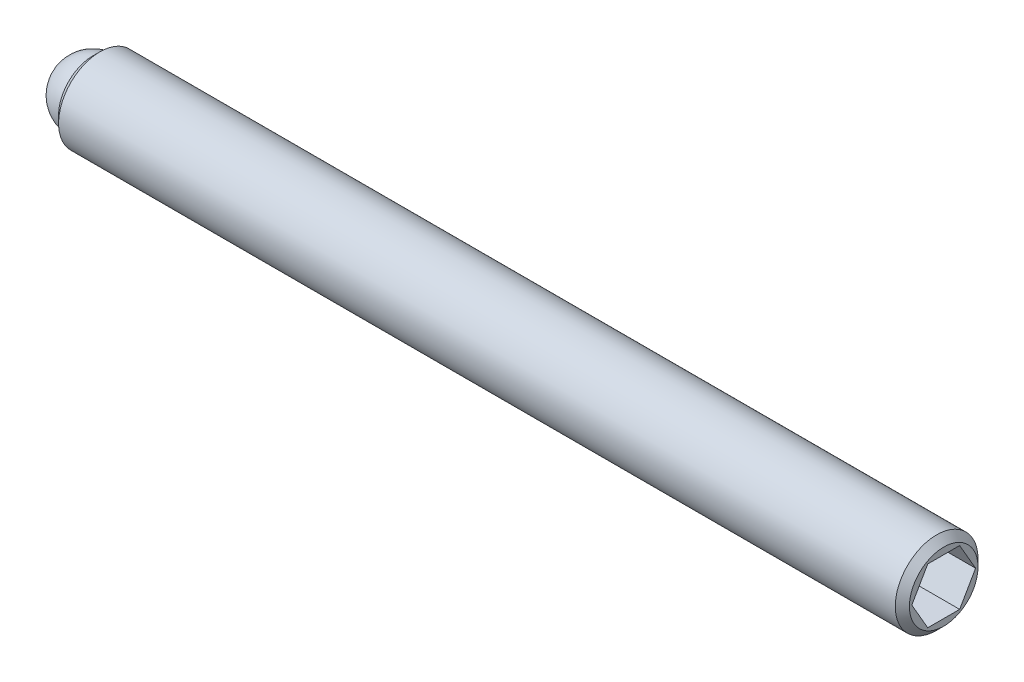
ISO-10303-21;
HEADER;
FILE_DESCRIPTION(('STEP AP214'),'2;1');
FILE_NAME('part.step','',(''),(''),'','','');
FILE_SCHEMA(('AUTOMOTIVE_DESIGN { 1 0 10303 214 1 1 1 1 }'));
ENDSEC;
DATA;
#1=APPLICATION_CONTEXT('core data for automotive mechanical design processes');
#2=APPLICATION_PROTOCOL_DEFINITION('international standard','automotive_design',2000,#1);
#3=PRODUCT_CONTEXT('',#1,'mechanical');
#4=PRODUCT('Part','Part','',(#3));
#5=PRODUCT_RELATED_PRODUCT_CATEGORY('part','',(#4));
#6=PRODUCT_DEFINITION_FORMATION('','',#4);
#7=PRODUCT_DEFINITION_CONTEXT('part definition',#1,'design');
#8=PRODUCT_DEFINITION('design','',#6,#7);
#9=PRODUCT_DEFINITION_SHAPE('','',#8);
#10=(LENGTH_UNIT() NAMED_UNIT(*) SI_UNIT(.MILLI.,.METRE.));
#11=(NAMED_UNIT(*) PLANE_ANGLE_UNIT() SI_UNIT($,.RADIAN.));
#12=(NAMED_UNIT(*) SI_UNIT($,.STERADIAN.) SOLID_ANGLE_UNIT());
#13=UNCERTAINTY_MEASURE_WITH_UNIT(LENGTH_MEASURE(1.E-05),#10,'distance_accuracy_value','');
#14=(GEOMETRIC_REPRESENTATION_CONTEXT(3) GLOBAL_UNCERTAINTY_ASSIGNED_CONTEXT((#13)) GLOBAL_UNIT_ASSIGNED_CONTEXT((#10,
#11,#12)) REPRESENTATION_CONTEXT('',''));
#15=CARTESIAN_POINT('',(0.,0.,0.));
#16=DIRECTION('',(0.,0.,1.));
#17=DIRECTION('',(1.,0.,0.));
#18=AXIS2_PLACEMENT_3D('',#15,#16,#17);
#19=CARTESIAN_POINT('',(0.,0.,0.));
#20=DIRECTION('',(0.,-1.,0.));
#21=DIRECTION('',(0.,0.,-1.));
#22=AXIS2_PLACEMENT_3D('',#19,#20,#21);
#23=SPHERICAL_SURFACE('',#22,1.190625);
#24=CARTESIAN_POINT('',(0.,-1.190625,0.));
#25=VERTEX_POINT('',#24);
#26=VERTEX_LOOP('',#25);
#27=FACE_BOUND('',#26,.T.);
#28=ADVANCED_FACE('F43',(#27),#23,.T.);
#29=CLOSED_SHELL('',(#28));
#30=MANIFOLD_SOLID_BREP('B2',#29);
#31=CARTESIAN_POINT('',(30.559375,0.,0.));
#32=DIRECTION('',(-1.,0.,0.));
#33=DIRECTION('',(0.,0.,1.));
#34=AXIS2_PLACEMENT_3D('',#31,#32,#33);
#35=CYLINDRICAL_SURFACE('',#34,1.4859);
#36=CARTESIAN_POINT('',(30.305375,0.,0.));
#37=DIRECTION('',(1.,0.,0.));
#38=DIRECTION('',(0.,0.,-1.));
#39=AXIS2_PLACEMENT_3D('',#36,#37,#38);
#40=CIRCLE('',#39,1.4859);
#41=CARTESIAN_POINT('',(30.305375,0.,-1.4859));
#42=VERTEX_POINT('',#41);
#43=EDGE_CURVE('E41',#42,#42,#40,.F.);
#44=ORIENTED_EDGE('',*,*,#43,.T.);
#45=EDGE_LOOP('',(#44));
#46=FACE_BOUND('',#45,.T.);
#47=CARTESIAN_POINT('',(0.253999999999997,0.,0.));
#48=DIRECTION('',(1.,0.,0.));
#49=DIRECTION('',(0.,0.,-1.));
#50=AXIS2_PLACEMENT_3D('',#47,#48,#49);
#51=CIRCLE('',#50,1.4859);
#52=CARTESIAN_POINT('',(0.253999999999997,0.,-1.4859));
#53=VERTEX_POINT('',#52);
#54=EDGE_CURVE('E159',#53,#53,#51,.T.);
#55=ORIENTED_EDGE('',*,*,#54,.T.);
#56=EDGE_LOOP('',(#55));
#57=FACE_BOUND('',#56,.T.);
#58=ADVANCED_FACE('F56',(#46,#57),#35,.T.);
#59=CARTESIAN_POINT('',(30.559375,0.,0.));
#60=DIRECTION('',(1.,0.,0.));
#61=DIRECTION('',(0.,0.,-1.));
#62=AXIS2_PLACEMENT_3D('',#59,#60,#61);
#63=PLANE('',#62);
#64=DIRECTION('',(0.,0.866025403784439,-0.5));
#65=VECTOR('',#64,1.);
#66=CARTESIAN_POINT('',(30.559375,-0.992187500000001,-0.572839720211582));
#67=LINE('',#66,#65);
#68=CARTESIAN_POINT('',(30.559375,-0.992187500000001,-0.572839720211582));
#69=VERTEX_POINT('',#68);
#70=CARTESIAN_POINT('',(30.559375,0.,-1.14567944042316));
#71=VERTEX_POINT('',#70);
#72=EDGE_CURVE('E71',#69,#71,#67,.T.);
#73=ORIENTED_EDGE('',*,*,#72,.F.);
#74=DIRECTION('',(0.,0.,-1.));
#75=VECTOR('',#74,1.);
#76=CARTESIAN_POINT('',(30.559375,-0.992187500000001,0.572839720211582));
#77=LINE('',#76,#75);
#78=CARTESIAN_POINT('',(30.559375,-0.992187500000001,0.572839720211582));
#79=VERTEX_POINT('',#78);
#80=EDGE_CURVE('E155',#79,#69,#77,.T.);
#81=ORIENTED_EDGE('',*,*,#80,.F.);
#82=DIRECTION('',(0.,-0.866025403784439,-0.5));
#83=VECTOR('',#82,1.);
#84=CARTESIAN_POINT('',(30.559375,0.,1.14567944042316));
#85=LINE('',#84,#83);
#86=CARTESIAN_POINT('',(30.559375,0.,1.14567944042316));
#87=VERTEX_POINT('',#86);
#88=EDGE_CURVE('E153',#87,#79,#85,.T.);
#89=ORIENTED_EDGE('',*,*,#88,.F.);
#90=DIRECTION('',(0.,-0.866025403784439,0.5));
#91=VECTOR('',#90,1.);
#92=CARTESIAN_POINT('',(30.559375,0.992187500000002,0.572839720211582));
#93=LINE('',#92,#91);
#94=CARTESIAN_POINT('',(30.559375,0.992187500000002,0.572839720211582));
#95=VERTEX_POINT('',#94);
#96=EDGE_CURVE('E119',#95,#87,#93,.T.);
#97=ORIENTED_EDGE('',*,*,#96,.F.);
#98=DIRECTION('',(0.,0.,1.));
#99=VECTOR('',#98,1.);
#100=CARTESIAN_POINT('',(30.559375,0.992187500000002,-0.572839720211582));
#101=LINE('',#100,#99);
#102=CARTESIAN_POINT('',(30.559375,0.992187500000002,-0.572839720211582));
#103=VERTEX_POINT('',#102);
#104=EDGE_CURVE('E149',#103,#95,#101,.T.);
#105=ORIENTED_EDGE('',*,*,#104,.F.);
#106=DIRECTION('',(0.,0.866025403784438,0.5));
#107=VECTOR('',#106,1.);
#108=CARTESIAN_POINT('',(30.559375,0.,-1.14567944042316));
#109=LINE('',#108,#107);
#110=EDGE_CURVE('E145',#71,#103,#109,.T.);
#111=ORIENTED_EDGE('',*,*,#110,.F.);
#112=EDGE_LOOP('',(#73,#81,#89,#97,#105,#111));
#113=FACE_BOUND('',#112,.T.);
#114=CARTESIAN_POINT('',(30.559375,0.,0.));
#115=DIRECTION('',(1.,0.,0.));
#116=DIRECTION('',(0.,0.,-1.));
#117=AXIS2_PLACEMENT_3D('',#114,#115,#116);
#118=CIRCLE('',#117,1.2319);
#119=CARTESIAN_POINT('',(30.559375,0.,-1.2319));
#120=VERTEX_POINT('',#119);
#121=EDGE_CURVE('E64',#120,#120,#118,.T.);
#122=ORIENTED_EDGE('',*,*,#121,.T.);
#123=EDGE_LOOP('',(#122));
#124=FACE_BOUND('',#123,.T.);
#125=ADVANCED_FACE('F172',(#113,#124),#63,.T.);
#126=CARTESIAN_POINT('',(0.,0.,0.));
#127=DIRECTION('',(1.,0.,0.));
#128=DIRECTION('',(0.,0.,-1.));
#129=AXIS2_PLACEMENT_3D('',#126,#127,#128);
#130=PLANE('',#129);
#131=CARTESIAN_POINT('',(0.,0.,0.));
#132=DIRECTION('',(-1.,0.,0.));
#133=DIRECTION('',(0.,0.,1.));
#134=AXIS2_PLACEMENT_3D('',#131,#132,#133);
#135=CIRCLE('',#134,1.190625);
#136=CARTESIAN_POINT('',(0.,0.,1.190625));
#137=VERTEX_POINT('',#136);
#138=EDGE_CURVE('E227',#137,#137,#135,.T.);
#139=ORIENTED_EDGE('',*,*,#138,.F.);
#140=EDGE_LOOP('',(#139));
#141=FACE_BOUND('',#140,.T.);
#142=CARTESIAN_POINT('',(0.,0.,0.));
#143=DIRECTION('',(1.,0.,0.));
#144=DIRECTION('',(0.,0.,-1.));
#145=AXIS2_PLACEMENT_3D('',#142,#143,#144);
#146=CIRCLE('',#145,1.2319);
#147=CARTESIAN_POINT('',(0.,0.,-1.2319));
#148=VERTEX_POINT('',#147);
#149=EDGE_CURVE('E167',#148,#148,#146,.F.);
#150=ORIENTED_EDGE('',*,*,#149,.T.);
#151=EDGE_LOOP('',(#150));
#152=FACE_BOUND('',#151,.T.);
#153=ADVANCED_FACE('F184',(#141,#152),#130,.F.);
#154=CARTESIAN_POINT('',(0.253999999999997,0.,0.));
#155=DIRECTION('',(1.,0.,0.));
#156=DIRECTION('',(0.,0.,-1.));
#157=AXIS2_PLACEMENT_3D('',#154,#155,#156);
#158=CONICAL_SURFACE('',#157,1.4859,0.785398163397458);
#159=ORIENTED_EDGE('',*,*,#149,.F.);
#160=EDGE_LOOP('',(#159));
#161=FACE_BOUND('',#160,.T.);
#162=ORIENTED_EDGE('',*,*,#54,.F.);
#163=EDGE_LOOP('',(#162));
#164=FACE_BOUND('',#163,.T.);
#165=ADVANCED_FACE('F176',(#161,#164),#158,.T.);
#166=CARTESIAN_POINT('',(30.559375,0.,0.));
#167=DIRECTION('',(-1.,0.,0.));
#168=DIRECTION('',(0.,0.,1.));
#169=AXIS2_PLACEMENT_3D('',#166,#167,#168);
#170=CONICAL_SURFACE('',#169,1.2319,0.785398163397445);
#171=ORIENTED_EDGE('',*,*,#43,.F.);
#172=EDGE_LOOP('',(#171));
#173=FACE_BOUND('',#172,.T.);
#174=ORIENTED_EDGE('',*,*,#121,.F.);
#175=EDGE_LOOP('',(#174));
#176=FACE_BOUND('',#175,.T.);
#177=ADVANCED_FACE('F58',(#173,#176),#170,.T.);
#178=CARTESIAN_POINT('',(28.273375,-0.992187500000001,-0.572839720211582));
#179=DIRECTION('',(0.,-0.5,-0.866025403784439));
#180=DIRECTION('',(0.,0.866025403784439,-0.5));
#181=AXIS2_PLACEMENT_3D('',#178,#179,#180);
#182=PLANE('',#181);
#183=ORIENTED_EDGE('',*,*,#72,.T.);
#184=DIRECTION('',(1.,0.,0.));
#185=VECTOR('',#184,1.);
#186=CARTESIAN_POINT('',(28.273375,0.,-1.14567944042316));
#187=LINE('',#186,#185);
#188=CARTESIAN_POINT('',(28.273375,0.,-1.14567944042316));
#189=VERTEX_POINT('',#188);
#190=EDGE_CURVE('E101',#189,#71,#187,.T.);
#191=ORIENTED_EDGE('',*,*,#190,.F.);
#192=DIRECTION('',(0.,0.866025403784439,-0.5));
#193=VECTOR('',#192,1.);
#194=CARTESIAN_POINT('',(28.273375,-0.992187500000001,-0.572839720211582));
#195=LINE('',#194,#193);
#196=CARTESIAN_POINT('',(28.273375,-0.992187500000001,-0.572839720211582));
#197=VERTEX_POINT('',#196);
#198=EDGE_CURVE('E157',#197,#189,#195,.T.);
#199=ORIENTED_EDGE('',*,*,#198,.F.);
#200=DIRECTION('',(1.,0.,0.));
#201=VECTOR('',#200,1.);
#202=CARTESIAN_POINT('',(28.273375,-0.992187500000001,-0.572839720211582));
#203=LINE('',#202,#201);
#204=EDGE_CURVE('E79',#197,#69,#203,.T.);
#205=ORIENTED_EDGE('',*,*,#204,.T.);
#206=EDGE_LOOP('',(#183,#191,#199,#205));
#207=FACE_BOUND('',#206,.T.);
#208=ADVANCED_FACE('F175',(#207),#182,.F.);
#209=CARTESIAN_POINT('',(28.273375,-0.992187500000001,0.572839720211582));
#210=DIRECTION('',(0.,-1.,0.));
#211=DIRECTION('',(0.,0.,-1.));
#212=AXIS2_PLACEMENT_3D('',#209,#210,#211);
#213=PLANE('',#212);
#214=ORIENTED_EDGE('',*,*,#80,.T.);
#215=ORIENTED_EDGE('',*,*,#204,.F.);
#216=DIRECTION('',(0.,0.,-1.));
#217=VECTOR('',#216,1.);
#218=CARTESIAN_POINT('',(28.273375,-0.992187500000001,0.572839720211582));
#219=LINE('',#218,#217);
#220=CARTESIAN_POINT('',(28.273375,-0.992187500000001,0.572839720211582));
#221=VERTEX_POINT('',#220);
#222=EDGE_CURVE('E131',#221,#197,#219,.T.);
#223=ORIENTED_EDGE('',*,*,#222,.F.);
#224=DIRECTION('',(1.,0.,0.));
#225=VECTOR('',#224,1.);
#226=CARTESIAN_POINT('',(28.273375,-0.992187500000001,0.572839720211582));
#227=LINE('',#226,#225);
#228=EDGE_CURVE('E123',#221,#79,#227,.T.);
#229=ORIENTED_EDGE('',*,*,#228,.T.);
#230=EDGE_LOOP('',(#214,#215,#223,#229));
#231=FACE_BOUND('',#230,.T.);
#232=ADVANCED_FACE('F182',(#231),#213,.F.);
#233=CARTESIAN_POINT('',(28.273375,0.,1.14567944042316));
#234=DIRECTION('',(0.,-0.5,0.866025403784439));
#235=DIRECTION('',(0.,-0.866025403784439,-0.5));
#236=AXIS2_PLACEMENT_3D('',#233,#234,#235);
#237=PLANE('',#236);
#238=ORIENTED_EDGE('',*,*,#88,.T.);
#239=ORIENTED_EDGE('',*,*,#228,.F.);
#240=DIRECTION('',(0.,-0.866025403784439,-0.5));
#241=VECTOR('',#240,1.);
#242=CARTESIAN_POINT('',(28.273375,0.,1.14567944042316));
#243=LINE('',#242,#241);
#244=CARTESIAN_POINT('',(28.273375,0.,1.14567944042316));
#245=VERTEX_POINT('',#244);
#246=EDGE_CURVE('E127',#245,#221,#243,.T.);
#247=ORIENTED_EDGE('',*,*,#246,.F.);
#248=DIRECTION('',(1.,0.,0.));
#249=VECTOR('',#248,1.);
#250=CARTESIAN_POINT('',(28.273375,0.,1.14567944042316));
#251=LINE('',#250,#249);
#252=EDGE_CURVE('E112',#245,#87,#251,.T.);
#253=ORIENTED_EDGE('',*,*,#252,.T.);
#254=EDGE_LOOP('',(#238,#239,#247,#253));
#255=FACE_BOUND('',#254,.T.);
#256=ADVANCED_FACE('F128',(#255),#237,.F.);
#257=CARTESIAN_POINT('',(28.273375,0.992187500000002,0.572839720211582));
#258=DIRECTION('',(0.,0.5,0.866025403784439));
#259=DIRECTION('',(0.,-0.866025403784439,0.5));
#260=AXIS2_PLACEMENT_3D('',#257,#258,#259);
#261=PLANE('',#260);
#262=ORIENTED_EDGE('',*,*,#96,.T.);
#263=ORIENTED_EDGE('',*,*,#252,.F.);
#264=DIRECTION('',(0.,-0.866025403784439,0.5));
#265=VECTOR('',#264,1.);
#266=CARTESIAN_POINT('',(28.273375,0.992187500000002,0.572839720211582));
#267=LINE('',#266,#265);
#268=CARTESIAN_POINT('',(28.273375,0.992187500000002,0.572839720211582));
#269=VERTEX_POINT('',#268);
#270=EDGE_CURVE('E116',#269,#245,#267,.T.);
#271=ORIENTED_EDGE('',*,*,#270,.F.);
#272=DIRECTION('',(1.,0.,0.));
#273=VECTOR('',#272,1.);
#274=CARTESIAN_POINT('',(28.273375,0.992187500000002,0.572839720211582));
#275=LINE('',#274,#273);
#276=EDGE_CURVE('E124',#269,#95,#275,.T.);
#277=ORIENTED_EDGE('',*,*,#276,.T.);
#278=EDGE_LOOP('',(#262,#263,#271,#277));
#279=FACE_BOUND('',#278,.T.);
#280=ADVANCED_FACE('F114',(#279),#261,.F.);
#281=CARTESIAN_POINT('',(28.273375,0.992187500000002,-0.572839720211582));
#282=DIRECTION('',(0.,1.,0.));
#283=DIRECTION('',(0.,0.,1.));
#284=AXIS2_PLACEMENT_3D('',#281,#282,#283);
#285=PLANE('',#284);
#286=ORIENTED_EDGE('',*,*,#104,.T.);
#287=ORIENTED_EDGE('',*,*,#276,.F.);
#288=DIRECTION('',(0.,0.,1.));
#289=VECTOR('',#288,1.);
#290=CARTESIAN_POINT('',(28.273375,0.992187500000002,-0.572839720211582));
#291=LINE('',#290,#289);
#292=CARTESIAN_POINT('',(28.273375,0.992187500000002,-0.572839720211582));
#293=VERTEX_POINT('',#292);
#294=EDGE_CURVE('E137',#293,#269,#291,.T.);
#295=ORIENTED_EDGE('',*,*,#294,.F.);
#296=DIRECTION('',(1.,0.,0.));
#297=VECTOR('',#296,1.);
#298=CARTESIAN_POINT('',(28.273375,0.992187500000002,-0.572839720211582));
#299=LINE('',#298,#297);
#300=EDGE_CURVE('E162',#293,#103,#299,.T.);
#301=ORIENTED_EDGE('',*,*,#300,.T.);
#302=EDGE_LOOP('',(#286,#287,#295,#301));
#303=FACE_BOUND('',#302,.T.);
#304=ADVANCED_FACE('F203',(#303),#285,.F.);
#305=CARTESIAN_POINT('',(28.273375,0.,-1.14567944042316));
#306=DIRECTION('',(0.,0.5,-0.866025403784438));
#307=DIRECTION('',(0.,0.866025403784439,0.5));
#308=AXIS2_PLACEMENT_3D('',#305,#306,#307);
#309=PLANE('',#308);
#310=ORIENTED_EDGE('',*,*,#110,.T.);
#311=ORIENTED_EDGE('',*,*,#300,.F.);
#312=DIRECTION('',(0.,0.866025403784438,0.5));
#313=VECTOR('',#312,1.);
#314=CARTESIAN_POINT('',(28.273375,0.,-1.14567944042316));
#315=LINE('',#314,#313);
#316=EDGE_CURVE('E139',#189,#293,#315,.T.);
#317=ORIENTED_EDGE('',*,*,#316,.F.);
#318=ORIENTED_EDGE('',*,*,#190,.T.);
#319=EDGE_LOOP('',(#310,#311,#317,#318));
#320=FACE_BOUND('',#319,.T.);
#321=ADVANCED_FACE('F200',(#320),#309,.F.);
#322=CARTESIAN_POINT('',(28.273375,0.,0.));
#323=DIRECTION('',(1.,0.,0.));
#324=DIRECTION('',(0.,0.,-1.));
#325=AXIS2_PLACEMENT_3D('',#322,#323,#324);
#326=PLANE('',#325);
#327=ORIENTED_EDGE('',*,*,#198,.T.);
#328=ORIENTED_EDGE('',*,*,#316,.T.);
#329=ORIENTED_EDGE('',*,*,#294,.T.);
#330=ORIENTED_EDGE('',*,*,#270,.T.);
#331=ORIENTED_EDGE('',*,*,#246,.T.);
#332=ORIENTED_EDGE('',*,*,#222,.T.);
#333=EDGE_LOOP('',(#327,#328,#329,#330,#331,#332));
#334=FACE_BOUND('',#333,.T.);
#335=ADVANCED_FACE('F134',(#334),#326,.T.);
#336=CARTESIAN_POINT('',(1.190625,0.,0.));
#337=DIRECTION('',(-1.,0.,0.));
#338=DIRECTION('',(0.,0.,1.));
#339=AXIS2_PLACEMENT_3D('',#336,#337,#338);
#340=CYLINDRICAL_SURFACE('',#339,1.190625);
#341=CARTESIAN_POINT('',(1.190625,0.,0.));
#342=DIRECTION('',(-1.,0.,0.));
#343=DIRECTION('',(0.,0.,1.));
#344=AXIS2_PLACEMENT_3D('',#341,#342,#343);
#345=CIRCLE('',#344,1.190625);
#346=CARTESIAN_POINT('',(1.190625,0.,1.190625));
#347=VERTEX_POINT('',#346);
#348=EDGE_CURVE('E146',#347,#347,#345,.T.);
#349=CARTESIAN_POINT('',(1.190625,0.,1.190625));
#350=CARTESIAN_POINT('',(1.17822265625,0.,1.190625));
#351=CARTESIAN_POINT('',(1.1658203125,0.,1.190625));
#352=CARTESIAN_POINT('',(1.141015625,0.,1.190625));
#353=CARTESIAN_POINT('',(1.12861328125,0.,1.190625));
#354=CARTESIAN_POINT('',(1.10380859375,0.,1.190625));
#355=CARTESIAN_POINT('',(1.09140625,0.,1.190625));
#356=CARTESIAN_POINT('',(1.0666015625,0.,1.190625));
#357=CARTESIAN_POINT('',(1.05419921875,0.,1.190625));
#358=CARTESIAN_POINT('',(1.02939453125,0.,1.190625));
#359=CARTESIAN_POINT('',(1.0169921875,0.,1.190625));
#360=CARTESIAN_POINT('',(0.9921875,0.,1.190625));
#361=CARTESIAN_POINT('',(0.97978515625,0.,1.190625));
#362=CARTESIAN_POINT('',(0.95498046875,0.,1.190625));
#363=CARTESIAN_POINT('',(0.942578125,0.,1.190625));
#364=CARTESIAN_POINT('',(0.9177734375,0.,1.190625));
#365=CARTESIAN_POINT('',(0.90537109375,0.,1.190625));
#366=CARTESIAN_POINT('',(0.88056640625,0.,1.190625));
#367=CARTESIAN_POINT('',(0.8681640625,0.,1.190625));
#368=CARTESIAN_POINT('',(0.843359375,0.,1.190625));
#369=CARTESIAN_POINT('',(0.83095703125,0.,1.190625));
#370=CARTESIAN_POINT('',(0.80615234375,0.,1.190625));
#371=CARTESIAN_POINT('',(0.79375,0.,1.190625));
#372=CARTESIAN_POINT('',(0.7689453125,0.,1.190625));
#373=CARTESIAN_POINT('',(0.75654296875,0.,1.190625));
#374=CARTESIAN_POINT('',(0.73173828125,0.,1.190625));
#375=CARTESIAN_POINT('',(0.7193359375,0.,1.190625));
#376=CARTESIAN_POINT('',(0.69453125,0.,1.190625));
#377=CARTESIAN_POINT('',(0.68212890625,0.,1.190625));
#378=CARTESIAN_POINT('',(0.65732421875,0.,1.190625));
#379=CARTESIAN_POINT('',(0.644921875,0.,1.190625));
#380=CARTESIAN_POINT('',(0.6201171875,0.,1.190625));
#381=CARTESIAN_POINT('',(0.60771484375,0.,1.190625));
#382=CARTESIAN_POINT('',(0.58291015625,0.,1.190625));
#383=CARTESIAN_POINT('',(0.5705078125,0.,1.190625));
#384=CARTESIAN_POINT('',(0.545703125,0.,1.190625));
#385=CARTESIAN_POINT('',(0.53330078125,0.,1.190625));
#386=CARTESIAN_POINT('',(0.50849609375,0.,1.190625));
#387=CARTESIAN_POINT('',(0.49609375,0.,1.190625));
#388=CARTESIAN_POINT('',(0.4712890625,0.,1.190625));
#389=CARTESIAN_POINT('',(0.45888671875,0.,1.190625));
#390=CARTESIAN_POINT('',(0.43408203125,0.,1.190625));
#391=CARTESIAN_POINT('',(0.4216796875,0.,1.190625));
#392=CARTESIAN_POINT('',(0.396875,0.,1.190625));
#393=CARTESIAN_POINT('',(0.38447265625,0.,1.190625));
#394=CARTESIAN_POINT('',(0.35966796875,0.,1.190625));
#395=CARTESIAN_POINT('',(0.347265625,0.,1.190625));
#396=CARTESIAN_POINT('',(0.3224609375,0.,1.190625));
#397=CARTESIAN_POINT('',(0.31005859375,0.,1.190625));
#398=CARTESIAN_POINT('',(0.28525390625,0.,1.190625));
#399=CARTESIAN_POINT('',(0.2728515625,0.,1.190625));
#400=CARTESIAN_POINT('',(0.248046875,0.,1.190625));
#401=CARTESIAN_POINT('',(0.23564453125,0.,1.190625));
#402=CARTESIAN_POINT('',(0.21083984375,0.,1.190625));
#403=CARTESIAN_POINT('',(0.1984375,0.,1.190625));
#404=CARTESIAN_POINT('',(0.1736328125,0.,1.190625));
#405=CARTESIAN_POINT('',(0.16123046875,0.,1.190625));
#406=CARTESIAN_POINT('',(0.13642578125,0.,1.190625));
#407=CARTESIAN_POINT('',(0.1240234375,0.,1.190625));
#408=CARTESIAN_POINT('',(0.0992187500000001,0.,1.190625));
#409=CARTESIAN_POINT('',(0.08681640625,0.,1.190625));
#410=CARTESIAN_POINT('',(0.06201171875,0.,1.190625));
#411=CARTESIAN_POINT('',(0.049609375,0.,1.190625));
#412=CARTESIAN_POINT('',(0.0248046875,0.,1.190625));
#413=CARTESIAN_POINT('',(0.01240234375,0.,1.190625));
#414=CARTESIAN_POINT('',(0.,0.,1.190625));
#415=B_SPLINE_CURVE_WITH_KNOTS('',3,(#349,#350,#351,#352,#353,#354,#355,#356,#357,#358,#359,
#360,#361,#362,#363,#364,#365,#366,#367,#368,#369,#370,#371,#372,#373,#374,#375,#376,#377,#378,
#379,#380,#381,#382,#383,#384,#385,#386,#387,#388,#389,#390,#391,#392,#393,#394,#395,#396,#397,
#398,#399,#400,#401,#402,#403,#404,#405,#406,#407,#408,#409,#410,#411,#412,#413,#414),
.UNSPECIFIED.,.F.,.F.,(4,2,2,2,2,2,2,2,2,2,2,2,2,2,2,2,2,2,2,2,2,2,2,2,2,2,2,2,2,2,2,2,4),(0.,
0.03720703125,0.0744140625,0.11162109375,0.148828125,0.18603515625,0.2232421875,0.26044921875,
0.29765625,0.33486328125,0.3720703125,0.40927734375,0.446484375,0.48369140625,0.5208984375,
0.55810546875,0.5953125,0.63251953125,0.6697265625,0.70693359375,0.744140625,0.78134765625,
0.8185546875,0.85576171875,0.89296875,0.93017578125,0.9673828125,1.00458984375,1.041796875,
1.07900390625,1.1162109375,1.15341796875,1.190625),.UNSPECIFIED.);
#416=EDGE_CURVE('BSEAM216',#347,#137,#415,.T.);
#417=ORIENTED_EDGE('',*,*,#348,.F.);
#418=ORIENTED_EDGE('',*,*,#138,.T.);
#419=ORIENTED_EDGE('',*,*,#416,.T.);
#420=ORIENTED_EDGE('',*,*,#416,.F.);
#421=EDGE_LOOP('',(#417,#419,#418,#420));
#422=FACE_BOUND('',#421,.T.);
#423=ADVANCED_FACE('F216',(#422),#340,.F.);
#424=CARTESIAN_POINT('',(1.190625,0.,0.));
#425=DIRECTION('',(-1.,0.,0.));
#426=DIRECTION('',(0.,0.,1.));
#427=AXIS2_PLACEMENT_3D('',#424,#425,#426);
#428=PLANE('',#427);
#429=ORIENTED_EDGE('',*,*,#348,.T.);
#430=EDGE_LOOP('',(#429));
#431=FACE_BOUND('',#430,.T.);
#432=ADVANCED_FACE('F219',(#431),#428,.T.);
#433=CLOSED_SHELL('',(#58,#125,#153,#165,#177,#208,#232,#256,#280,#304,#321,#335,#423,#432));
#434=MANIFOLD_SOLID_BREP('B6',#433);
#435=ADVANCED_BREP_SHAPE_REPRESENTATION('',(#18,#30,#434),#14);
#436=SHAPE_DEFINITION_REPRESENTATION(#9,#435);
ENDSEC;
END-ISO-10303-21;
